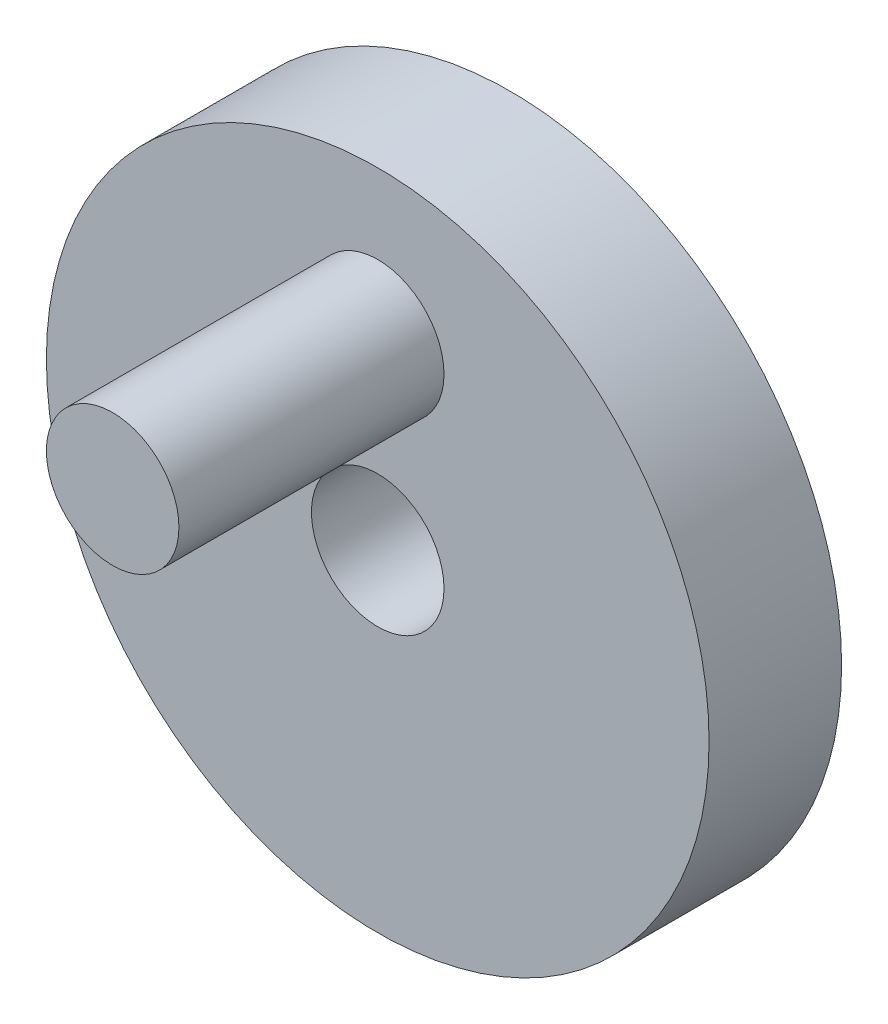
ISO-10303-21;
HEADER;
FILE_DESCRIPTION(('STEP AP214'),'2;1');
FILE_NAME('part.step','',(''),(''),'','','');
FILE_SCHEMA(('AUTOMOTIVE_DESIGN { 1 0 10303 214 1 1 1 1 }'));
ENDSEC;
DATA;
#1=APPLICATION_CONTEXT('core data for automotive mechanical design processes');
#2=APPLICATION_PROTOCOL_DEFINITION('international standard','automotive_design',2000,#1);
#3=PRODUCT_CONTEXT('',#1,'mechanical');
#4=PRODUCT('Part','Part','',(#3));
#5=PRODUCT_RELATED_PRODUCT_CATEGORY('part','',(#4));
#6=PRODUCT_DEFINITION_FORMATION('','',#4);
#7=PRODUCT_DEFINITION_CONTEXT('part definition',#1,'design');
#8=PRODUCT_DEFINITION('design','',#6,#7);
#9=PRODUCT_DEFINITION_SHAPE('','',#8);
#10=(LENGTH_UNIT() NAMED_UNIT(*) SI_UNIT(.MILLI.,.METRE.));
#11=(NAMED_UNIT(*) PLANE_ANGLE_UNIT() SI_UNIT($,.RADIAN.));
#12=(NAMED_UNIT(*) SI_UNIT($,.STERADIAN.) SOLID_ANGLE_UNIT());
#13=UNCERTAINTY_MEASURE_WITH_UNIT(LENGTH_MEASURE(1.E-05),#10,'distance_accuracy_value','');
#14=(GEOMETRIC_REPRESENTATION_CONTEXT(3) GLOBAL_UNCERTAINTY_ASSIGNED_CONTEXT((#13)) GLOBAL_UNIT_ASSIGNED_CONTEXT((#10,
#11,#12)) REPRESENTATION_CONTEXT('',''));
#15=CARTESIAN_POINT('',(0.,0.,0.));
#16=DIRECTION('',(0.,0.,1.));
#17=DIRECTION('',(1.,0.,0.));
#18=AXIS2_PLACEMENT_3D('',#15,#16,#17);
#19=CARTESIAN_POINT('',(0.,0.,10.));
#20=DIRECTION('',(0.,0.,1.));
#21=DIRECTION('',(1.,0.,0.));
#22=AXIS2_PLACEMENT_3D('',#19,#20,#21);
#23=PLANE('',#22);
#24=CARTESIAN_POINT('',(0.,0.,10.));
#25=DIRECTION('',(0.,0.,1.));
#26=DIRECTION('',(1.,0.,0.));
#27=AXIS2_PLACEMENT_3D('',#24,#25,#26);
#28=CIRCLE('',#27,25.);
#29=CARTESIAN_POINT('',(25.,0.,10.));
#30=VERTEX_POINT('',#29);
#31=EDGE_CURVE('E10',#30,#30,#28,.T.);
#32=ORIENTED_EDGE('',*,*,#31,.T.);
#33=EDGE_LOOP('',(#32));
#34=FACE_BOUND('',#33,.T.);
#35=CARTESIAN_POINT('',(0.,0.,10.));
#36=DIRECTION('',(0.,0.,1.));
#37=DIRECTION('',(1.,0.,0.));
#38=AXIS2_PLACEMENT_3D('',#35,#36,#37);
#39=CIRCLE('',#38,5.);
#40=CARTESIAN_POINT('',(5.,0.,10.));
#41=VERTEX_POINT('',#40);
#42=EDGE_CURVE('E46',#41,#41,#39,.T.);
#43=ORIENTED_EDGE('',*,*,#42,.F.);
#44=EDGE_LOOP('',(#43));
#45=FACE_BOUND('',#44,.T.);
#46=CARTESIAN_POINT('',(0.,14.,10.));
#47=DIRECTION('',(0.,0.,1.));
#48=DIRECTION('',(1.,0.,0.));
#49=AXIS2_PLACEMENT_3D('',#46,#47,#48);
#50=CIRCLE('',#49,5.);
#51=CARTESIAN_POINT('',(5.,14.,10.));
#52=VERTEX_POINT('',#51);
#53=EDGE_CURVE('E52',#52,#52,#50,.T.);
#54=ORIENTED_EDGE('',*,*,#53,.F.);
#55=EDGE_LOOP('',(#54));
#56=FACE_BOUND('',#55,.T.);
#57=ADVANCED_FACE('F33',(#34,#45,#56),#23,.T.);
#58=CARTESIAN_POINT('',(0.,0.,10.));
#59=DIRECTION('',(0.,0.,-1.));
#60=DIRECTION('',(-1.,0.,0.));
#61=AXIS2_PLACEMENT_3D('',#58,#59,#60);
#62=CYLINDRICAL_SURFACE('',#61,25.);
#63=ORIENTED_EDGE('',*,*,#31,.F.);
#64=EDGE_LOOP('',(#63));
#65=FACE_BOUND('',#64,.T.);
#66=CARTESIAN_POINT('',(0.,0.,0.));
#67=DIRECTION('',(0.,0.,1.));
#68=DIRECTION('',(1.,0.,0.));
#69=AXIS2_PLACEMENT_3D('',#66,#67,#68);
#70=CIRCLE('',#69,25.);
#71=CARTESIAN_POINT('',(25.,0.,0.));
#72=VERTEX_POINT('',#71);
#73=EDGE_CURVE('E37',#72,#72,#70,.T.);
#74=ORIENTED_EDGE('',*,*,#73,.T.);
#75=EDGE_LOOP('',(#74));
#76=FACE_BOUND('',#75,.T.);
#77=ADVANCED_FACE('F35',(#65,#76),#62,.T.);
#78=CARTESIAN_POINT('',(0.,0.,0.));
#79=DIRECTION('',(0.,0.,1.));
#80=DIRECTION('',(1.,0.,0.));
#81=AXIS2_PLACEMENT_3D('',#78,#79,#80);
#82=PLANE('',#81);
#83=CARTESIAN_POINT('',(0.,0.,0.));
#84=DIRECTION('',(0.,0.,1.));
#85=DIRECTION('',(1.,0.,0.));
#86=AXIS2_PLACEMENT_3D('',#83,#84,#85);
#87=CIRCLE('',#86,5.);
#88=CARTESIAN_POINT('',(5.,0.,0.));
#89=VERTEX_POINT('',#88);
#90=EDGE_CURVE('E44',#89,#89,#87,.T.);
#91=ORIENTED_EDGE('',*,*,#90,.T.);
#92=EDGE_LOOP('',(#91));
#93=FACE_BOUND('',#92,.T.);
#94=ORIENTED_EDGE('',*,*,#73,.F.);
#95=EDGE_LOOP('',(#94));
#96=FACE_BOUND('',#95,.T.);
#97=ADVANCED_FACE('F72',(#93,#96),#82,.F.);
#98=CARTESIAN_POINT('',(0.,0.,0.));
#99=DIRECTION('',(0.,0.,1.));
#100=DIRECTION('',(1.,0.,0.));
#101=AXIS2_PLACEMENT_3D('',#98,#99,#100);
#102=CYLINDRICAL_SURFACE('',#101,5.);
#103=ORIENTED_EDGE('',*,*,#90,.F.);
#104=EDGE_LOOP('',(#103));
#105=FACE_BOUND('',#104,.T.);
#106=ORIENTED_EDGE('',*,*,#42,.T.);
#107=EDGE_LOOP('',(#106));
#108=FACE_BOUND('',#107,.T.);
#109=ADVANCED_FACE('F63',(#105,#108),#102,.F.);
#110=CARTESIAN_POINT('',(0.,14.,30.));
#111=DIRECTION('',(0.,0.,-1.));
#112=DIRECTION('',(-1.,0.,0.));
#113=AXIS2_PLACEMENT_3D('',#110,#111,#112);
#114=CYLINDRICAL_SURFACE('',#113,5.);
#115=CARTESIAN_POINT('',(0.,14.,30.));
#116=DIRECTION('',(0.,0.,1.));
#117=DIRECTION('',(1.,0.,0.));
#118=AXIS2_PLACEMENT_3D('',#115,#116,#117);
#119=CIRCLE('',#118,5.);
#120=CARTESIAN_POINT('',(5.,14.,30.));
#121=VERTEX_POINT('',#120);
#122=EDGE_CURVE('E49',#121,#121,#119,.T.);
#123=ORIENTED_EDGE('',*,*,#122,.F.);
#124=EDGE_LOOP('',(#123));
#125=FACE_BOUND('',#124,.T.);
#126=ORIENTED_EDGE('',*,*,#53,.T.);
#127=EDGE_LOOP('',(#126));
#128=FACE_BOUND('',#127,.T.);
#129=ADVANCED_FACE('F60',(#125,#128),#114,.T.);
#130=CARTESIAN_POINT('',(0.,14.,30.));
#131=DIRECTION('',(0.,0.,1.));
#132=DIRECTION('',(1.,0.,0.));
#133=AXIS2_PLACEMENT_3D('',#130,#131,#132);
#134=PLANE('',#133);
#135=ORIENTED_EDGE('',*,*,#122,.T.);
#136=EDGE_LOOP('',(#135));
#137=FACE_BOUND('',#136,.T.);
#138=ADVANCED_FACE('F58',(#137),#134,.T.);
#139=CLOSED_SHELL('',(#57,#77,#97,#109,#129,#138));
#140=MANIFOLD_SOLID_BREP('B2',#139);
#141=ADVANCED_BREP_SHAPE_REPRESENTATION('',(#18,#140),#14);
#142=SHAPE_DEFINITION_REPRESENTATION(#9,#141);
ENDSEC;
END-ISO-10303-21;
